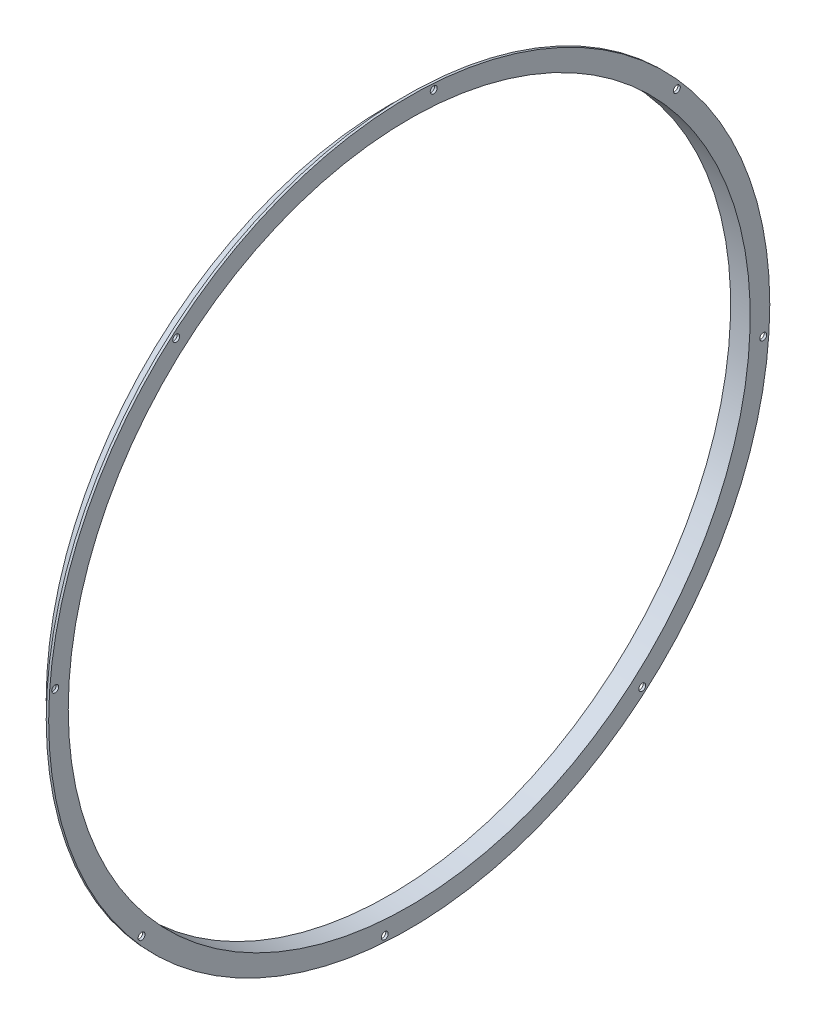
ISO-10303-21;
HEADER;
FILE_DESCRIPTION(('STEP AP214'),'2;1');
FILE_NAME('part.step','',(''),(''),'','','');
FILE_SCHEMA(('AUTOMOTIVE_DESIGN { 1 0 10303 214 1 1 1 1 }'));
ENDSEC;
DATA;
#1=APPLICATION_CONTEXT('core data for automotive mechanical design processes');
#2=APPLICATION_PROTOCOL_DEFINITION('international standard','automotive_design',2000,#1);
#3=PRODUCT_CONTEXT('',#1,'mechanical');
#4=PRODUCT('Part','Part','',(#3));
#5=PRODUCT_RELATED_PRODUCT_CATEGORY('part','',(#4));
#6=PRODUCT_DEFINITION_FORMATION('','',#4);
#7=PRODUCT_DEFINITION_CONTEXT('part definition',#1,'design');
#8=PRODUCT_DEFINITION('design','',#6,#7);
#9=PRODUCT_DEFINITION_SHAPE('','',#8);
#10=(LENGTH_UNIT() NAMED_UNIT(*) SI_UNIT(.MILLI.,.METRE.));
#11=(NAMED_UNIT(*) PLANE_ANGLE_UNIT() SI_UNIT($,.RADIAN.));
#12=(NAMED_UNIT(*) SI_UNIT($,.STERADIAN.) SOLID_ANGLE_UNIT());
#13=UNCERTAINTY_MEASURE_WITH_UNIT(LENGTH_MEASURE(1.E-05),#10,'distance_accuracy_value','');
#14=(GEOMETRIC_REPRESENTATION_CONTEXT(3) GLOBAL_UNCERTAINTY_ASSIGNED_CONTEXT((#13)) GLOBAL_UNIT_ASSIGNED_CONTEXT((#10,
#11,#12)) REPRESENTATION_CONTEXT('',''));
#15=CARTESIAN_POINT('',(0.,0.,0.));
#16=DIRECTION('',(0.,0.,1.));
#17=DIRECTION('',(1.,0.,0.));
#18=AXIS2_PLACEMENT_3D('',#15,#16,#17);
#19=CARTESIAN_POINT('',(-76.2,1336.675,0.));
#20=DIRECTION('',(1.,0.,0.));
#21=DIRECTION('',(0.,0.,-1.));
#22=AXIS2_PLACEMENT_3D('',#19,#20,#21);
#23=PLANE('',#22);
#24=CARTESIAN_POINT('',(-76.2,0.,0.));
#25=DIRECTION('',(-1.,0.,0.));
#26=DIRECTION('',(0.,0.,1.));
#27=AXIS2_PLACEMENT_3D('',#24,#25,#26);
#28=CIRCLE('',#27,1327.15);
#29=CARTESIAN_POINT('',(-76.2,0.,1327.15));
#30=VERTEX_POINT('',#29);
#31=EDGE_CURVE('E9',#30,#30,#28,.T.);
#32=ORIENTED_EDGE('',*,*,#31,.F.);
#33=EDGE_LOOP('',(#32));
#34=FACE_BOUND('',#33,.T.);
#35=CARTESIAN_POINT('',(-76.2,0.,0.));
#36=DIRECTION('',(-1.,0.,0.));
#37=DIRECTION('',(0.,0.,1.));
#38=AXIS2_PLACEMENT_3D('',#35,#36,#37);
#39=CIRCLE('',#38,1336.675);
#40=CARTESIAN_POINT('',(-76.2,0.,1336.675));
#41=VERTEX_POINT('',#40);
#42=EDGE_CURVE('E33',#41,#41,#39,.T.);
#43=ORIENTED_EDGE('',*,*,#42,.T.);
#44=EDGE_LOOP('',(#43));
#45=FACE_BOUND('',#44,.T.);
#46=ADVANCED_FACE('F14',(#34,#45),#23,.F.);
#47=CARTESIAN_POINT('',(-301.625,0.,0.));
#48=DIRECTION('',(-1.,0.,0.));
#49=DIRECTION('',(0.,0.,1.));
#50=AXIS2_PLACEMENT_3D('',#47,#48,#49);
#51=CYLINDRICAL_SURFACE('',#50,1327.15);
#52=CARTESIAN_POINT('',(0.,0.,0.));
#53=DIRECTION('',(-1.,0.,0.));
#54=DIRECTION('',(0.,0.,1.));
#55=AXIS2_PLACEMENT_3D('',#52,#53,#54);
#56=CIRCLE('',#55,1327.15);
#57=CARTESIAN_POINT('',(0.,0.,1327.15));
#58=VERTEX_POINT('',#57);
#59=EDGE_CURVE('E21',#58,#58,#56,.T.);
#60=ORIENTED_EDGE('',*,*,#59,.F.);
#61=EDGE_LOOP('',(#60));
#62=FACE_BOUND('',#61,.T.);
#63=ORIENTED_EDGE('',*,*,#31,.T.);
#64=EDGE_LOOP('',(#63));
#65=FACE_BOUND('',#64,.T.);
#66=ADVANCED_FACE('F94',(#62,#65),#51,.F.);
#67=CARTESIAN_POINT('',(0.,1327.15,0.));
#68=DIRECTION('',(-1.,0.,0.));
#69=DIRECTION('',(0.,0.,1.));
#70=AXIS2_PLACEMENT_3D('',#67,#68,#69);
#71=PLANE('',#70);
#72=CARTESIAN_POINT('',(1.91344239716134E-13,1041.62952588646,906.925684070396));
#73=DIRECTION('',(1.,0.,0.));
#74=DIRECTION('',(0.,0.707106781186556,0.707106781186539));
#75=AXIS2_PLACEMENT_3D('',#72,#73,#74);
#76=CIRCLE('',#75,13.49375);
#77=CARTESIAN_POINT('',(1.93096988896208E-13,1051.17104801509,916.467206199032));
#78=VERTEX_POINT('',#77);
#79=EDGE_CURVE('E66',#78,#78,#76,.T.);
#80=ORIENTED_EDGE('',*,*,#79,.F.);
#81=EDGE_LOOP('',(#80));
#82=FACE_BOUND('',#81,.T.);
#83=CARTESIAN_POINT('',(0.,95.2500000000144,1377.83660247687));
#84=DIRECTION('',(1.,0.,0.));
#85=DIRECTION('',(0.,0.,1.));
#86=AXIS2_PLACEMENT_3D('',#83,#84,#85);
#87=CIRCLE('',#86,13.49375);
#88=CARTESIAN_POINT('',(0.,95.2500000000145,1391.33035247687));
#89=VERTEX_POINT('',#88);
#90=EDGE_CURVE('E56',#89,#89,#87,.T.);
#91=ORIENTED_EDGE('',*,*,#90,.F.);
#92=EDGE_LOOP('',(#91));
#93=FACE_BOUND('',#92,.T.);
#94=CARTESIAN_POINT('',(-1.66599545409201E-13,-906.925684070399,1041.62952588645));
#95=DIRECTION('',(1.,0.,0.));
#96=DIRECTION('',(0.,-0.707106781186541,0.707106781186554));
#97=AXIS2_PLACEMENT_3D('',#94,#95,#96);
#98=CIRCLE('',#97,13.49375);
#99=CARTESIAN_POINT('',(-1.68352294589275E-13,-916.467206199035,1051.17104801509));
#100=VERTEX_POINT('',#99);
#101=EDGE_CURVE('E53',#100,#100,#98,.T.);
#102=ORIENTED_EDGE('',*,*,#101,.F.);
#103=EDGE_LOOP('',(#102));
#104=FACE_BOUND('',#103,.T.);
#105=CARTESIAN_POINT('',(-2.53104477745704E-13,-1377.83660247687,95.2500000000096));
#106=DIRECTION('',(1.,0.,0.));
#107=DIRECTION('',(0.,-1.,0.));
#108=AXIS2_PLACEMENT_3D('',#105,#106,#107);
#109=CIRCLE('',#108,13.49375);
#110=CARTESIAN_POINT('',(-2.55583239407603E-13,-1391.33035247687,95.2500000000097));
#111=VERTEX_POINT('',#110);
#112=EDGE_CURVE('E50',#111,#111,#109,.T.);
#113=ORIENTED_EDGE('',*,*,#112,.F.);
#114=EDGE_LOOP('',(#113));
#115=FACE_BOUND('',#114,.T.);
#116=CARTESIAN_POINT('',(-1.91344239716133E-13,-1041.62952588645,-906.925684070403));
#117=DIRECTION('',(1.,0.,0.));
#118=DIRECTION('',(0.,-0.707106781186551,-0.707106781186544));
#119=AXIS2_PLACEMENT_3D('',#116,#117,#118);
#120=CIRCLE('',#119,13.49375);
#121=CARTESIAN_POINT('',(-1.93096988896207E-13,-1051.17104801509,-916.467206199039));
#122=VERTEX_POINT('',#121);
#123=EDGE_CURVE('E46',#122,#122,#120,.T.);
#124=ORIENTED_EDGE('',*,*,#123,.F.);
#125=EDGE_LOOP('',(#124));
#126=FACE_BOUND('',#125,.T.);
#127=CARTESIAN_POINT('',(0.,-95.2500000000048,-1377.83660247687));
#128=DIRECTION('',(1.,0.,0.));
#129=DIRECTION('',(0.,0.,-1.));
#130=AXIS2_PLACEMENT_3D('',#127,#128,#129);
#131=CIRCLE('',#130,13.49375);
#132=CARTESIAN_POINT('',(0.,-95.2500000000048,-1391.33035247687));
#133=VERTEX_POINT('',#132);
#134=EDGE_CURVE('E42',#133,#133,#131,.T.);
#135=ORIENTED_EDGE('',*,*,#134,.F.);
#136=EDGE_LOOP('',(#135));
#137=FACE_BOUND('',#136,.T.);
#138=CARTESIAN_POINT('',(1.66599545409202E-13,906.925684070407,-1041.62952588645));
#139=DIRECTION('',(1.,0.,0.));
#140=DIRECTION('',(0.,0.707106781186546,-0.707106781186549));
#141=AXIS2_PLACEMENT_3D('',#138,#139,#140);
#142=CIRCLE('',#141,13.49375);
#143=CARTESIAN_POINT('',(1.68352294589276E-13,916.467206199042,-1051.17104801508));
#144=VERTEX_POINT('',#143);
#145=EDGE_CURVE('E38',#144,#144,#142,.T.);
#146=ORIENTED_EDGE('',*,*,#145,.F.);
#147=EDGE_LOOP('',(#146));
#148=FACE_BOUND('',#147,.T.);
#149=CARTESIAN_POINT('',(2.53104477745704E-13,1377.83660247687,-95.2499999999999));
#150=DIRECTION('',(1.,0.,0.));
#151=DIRECTION('',(0.,1.,0.));
#152=AXIS2_PLACEMENT_3D('',#149,#150,#151);
#153=CIRCLE('',#152,13.49375);
#154=CARTESIAN_POINT('',(2.55583239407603E-13,1391.33035247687,-95.2499999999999));
#155=VERTEX_POINT('',#154);
#156=EDGE_CURVE('E34',#155,#155,#153,.T.);
#157=ORIENTED_EDGE('',*,*,#156,.F.);
#158=EDGE_LOOP('',(#157));
#159=FACE_BOUND('',#158,.T.);
#160=CARTESIAN_POINT('',(0.,0.,0.));
#161=DIRECTION('',(-1.,0.,0.));
#162=DIRECTION('',(0.,0.,1.));
#163=AXIS2_PLACEMENT_3D('',#160,#161,#162);
#164=CIRCLE('',#163,1403.35);
#165=CARTESIAN_POINT('',(0.,0.,1403.35));
#166=VERTEX_POINT('',#165);
#167=EDGE_CURVE('E26',#166,#166,#164,.T.);
#168=ORIENTED_EDGE('',*,*,#167,.F.);
#169=EDGE_LOOP('',(#168));
#170=FACE_BOUND('',#169,.T.);
#171=ORIENTED_EDGE('',*,*,#59,.T.);
#172=EDGE_LOOP('',(#171));
#173=FACE_BOUND('',#172,.T.);
#174=ADVANCED_FACE('F91',(#82,#93,#104,#115,#126,#137,#148,#159,#170,#173),#71,.F.);
#175=CARTESIAN_POINT('',(-301.625,0.,0.));
#176=DIRECTION('',(-1.,0.,0.));
#177=DIRECTION('',(0.,0.,1.));
#178=AXIS2_PLACEMENT_3D('',#175,#176,#177);
#179=CYLINDRICAL_SURFACE('',#178,1403.35);
#180=CARTESIAN_POINT('',(-9.52500000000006,0.,0.));
#181=DIRECTION('',(-1.,0.,0.));
#182=DIRECTION('',(0.,0.,1.));
#183=AXIS2_PLACEMENT_3D('',#180,#181,#182);
#184=CIRCLE('',#183,1403.35);
#185=CARTESIAN_POINT('',(-9.52500000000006,0.,1403.35));
#186=VERTEX_POINT('',#185);
#187=EDGE_CURVE('E84',#186,#186,#184,.T.);
#188=ORIENTED_EDGE('',*,*,#187,.F.);
#189=EDGE_LOOP('',(#188));
#190=FACE_BOUND('',#189,.T.);
#191=ORIENTED_EDGE('',*,*,#167,.T.);
#192=EDGE_LOOP('',(#191));
#193=FACE_BOUND('',#192,.T.);
#194=ADVANCED_FACE('F89',(#190,#193),#179,.T.);
#195=CARTESIAN_POINT('',(-9.52500000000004,1403.35,0.));
#196=DIRECTION('',(1.,0.,0.));
#197=DIRECTION('',(0.,0.,-1.));
#198=AXIS2_PLACEMENT_3D('',#195,#196,#197);
#199=PLANE('',#198);
#200=CARTESIAN_POINT('',(-9.52500000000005,1041.62952588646,906.925684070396));
#201=DIRECTION('',(1.,0.,0.));
#202=DIRECTION('',(0.,0.,-1.));
#203=AXIS2_PLACEMENT_3D('',#200,#201,#202);
#204=CIRCLE('',#203,13.49375);
#205=CARTESIAN_POINT('',(-9.52500000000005,1041.62952588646,893.431934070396));
#206=VERTEX_POINT('',#205);
#207=EDGE_CURVE('E17',#206,#206,#204,.T.);
#208=ORIENTED_EDGE('',*,*,#207,.T.);
#209=EDGE_LOOP('',(#208));
#210=FACE_BOUND('',#209,.T.);
#211=CARTESIAN_POINT('',(-9.52500000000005,95.2500000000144,1377.83660247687));
#212=DIRECTION('',(1.,0.,0.));
#213=DIRECTION('',(0.,0.,-1.));
#214=AXIS2_PLACEMENT_3D('',#211,#212,#213);
#215=CIRCLE('',#214,13.49375);
#216=CARTESIAN_POINT('',(-9.52500000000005,95.2500000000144,1364.34285247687));
#217=VERTEX_POINT('',#216);
#218=EDGE_CURVE('E54',#217,#217,#215,.T.);
#219=ORIENTED_EDGE('',*,*,#218,.T.);
#220=EDGE_LOOP('',(#219));
#221=FACE_BOUND('',#220,.T.);
#222=CARTESIAN_POINT('',(-9.52500000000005,-906.925684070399,1041.62952588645));
#223=DIRECTION('',(1.,0.,0.));
#224=DIRECTION('',(0.,0.,-1.));
#225=AXIS2_PLACEMENT_3D('',#222,#223,#224);
#226=CIRCLE('',#225,13.49375);
#227=CARTESIAN_POINT('',(-9.52500000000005,-906.925684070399,1028.13577588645));
#228=VERTEX_POINT('',#227);
#229=EDGE_CURVE('E51',#228,#228,#226,.T.);
#230=ORIENTED_EDGE('',*,*,#229,.T.);
#231=EDGE_LOOP('',(#230));
#232=FACE_BOUND('',#231,.T.);
#233=CARTESIAN_POINT('',(-9.52500000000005,-1377.83660247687,95.2500000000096));
#234=DIRECTION('',(1.,0.,0.));
#235=DIRECTION('',(0.,0.,-1.));
#236=AXIS2_PLACEMENT_3D('',#233,#234,#235);
#237=CIRCLE('',#236,13.49375);
#238=CARTESIAN_POINT('',(-9.52500000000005,-1377.83660247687,81.7562500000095));
#239=VERTEX_POINT('',#238);
#240=EDGE_CURVE('E47',#239,#239,#237,.T.);
#241=ORIENTED_EDGE('',*,*,#240,.T.);
#242=EDGE_LOOP('',(#241));
#243=FACE_BOUND('',#242,.T.);
#244=CARTESIAN_POINT('',(-9.52500000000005,-1041.62952588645,-906.925684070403));
#245=DIRECTION('',(1.,0.,0.));
#246=DIRECTION('',(0.,0.,-1.));
#247=AXIS2_PLACEMENT_3D('',#244,#245,#246);
#248=CIRCLE('',#247,13.49375);
#249=CARTESIAN_POINT('',(-9.52500000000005,-1041.62952588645,-920.419434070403));
#250=VERTEX_POINT('',#249);
#251=EDGE_CURVE('E43',#250,#250,#248,.T.);
#252=ORIENTED_EDGE('',*,*,#251,.T.);
#253=EDGE_LOOP('',(#252));
#254=FACE_BOUND('',#253,.T.);
#255=CARTESIAN_POINT('',(-9.52500000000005,-95.2500000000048,-1377.83660247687));
#256=DIRECTION('',(1.,0.,0.));
#257=DIRECTION('',(0.,0.,-1.));
#258=AXIS2_PLACEMENT_3D('',#255,#256,#257);
#259=CIRCLE('',#258,13.49375);
#260=CARTESIAN_POINT('',(-9.52500000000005,-95.2500000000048,-1391.33035247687));
#261=VERTEX_POINT('',#260);
#262=EDGE_CURVE('E39',#261,#261,#259,.T.);
#263=ORIENTED_EDGE('',*,*,#262,.T.);
#264=EDGE_LOOP('',(#263));
#265=FACE_BOUND('',#264,.T.);
#266=CARTESIAN_POINT('',(-9.52500000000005,906.925684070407,-1041.62952588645));
#267=DIRECTION('',(1.,0.,0.));
#268=DIRECTION('',(0.,0.,-1.));
#269=AXIS2_PLACEMENT_3D('',#266,#267,#268);
#270=CIRCLE('',#269,13.49375);
#271=CARTESIAN_POINT('',(-9.52500000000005,906.925684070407,-1055.12327588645));
#272=VERTEX_POINT('',#271);
#273=EDGE_CURVE('E35',#272,#272,#270,.T.);
#274=ORIENTED_EDGE('',*,*,#273,.T.);
#275=EDGE_LOOP('',(#274));
#276=FACE_BOUND('',#275,.T.);
#277=CARTESIAN_POINT('',(-9.52500000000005,1377.83660247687,-95.2499999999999));
#278=DIRECTION('',(1.,0.,0.));
#279=DIRECTION('',(0.,0.,-1.));
#280=AXIS2_PLACEMENT_3D('',#277,#278,#279);
#281=CIRCLE('',#280,13.49375);
#282=CARTESIAN_POINT('',(-9.52500000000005,1377.83660247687,-108.74375));
#283=VERTEX_POINT('',#282);
#284=EDGE_CURVE('E30',#283,#283,#281,.T.);
#285=ORIENTED_EDGE('',*,*,#284,.T.);
#286=EDGE_LOOP('',(#285));
#287=FACE_BOUND('',#286,.T.);
#288=CARTESIAN_POINT('',(-9.52500000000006,0.,0.));
#289=DIRECTION('',(-1.,0.,0.));
#290=DIRECTION('',(0.,0.,1.));
#291=AXIS2_PLACEMENT_3D('',#288,#289,#290);
#292=CIRCLE('',#291,1336.675);
#293=CARTESIAN_POINT('',(-9.52500000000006,0.,1336.675));
#294=VERTEX_POINT('',#293);
#295=EDGE_CURVE('E81',#294,#294,#292,.T.);
#296=ORIENTED_EDGE('',*,*,#295,.F.);
#297=EDGE_LOOP('',(#296));
#298=FACE_BOUND('',#297,.T.);
#299=ORIENTED_EDGE('',*,*,#187,.T.);
#300=EDGE_LOOP('',(#299));
#301=FACE_BOUND('',#300,.T.);
#302=ADVANCED_FACE('F109',(#210,#221,#232,#243,#254,#265,#276,#287,#298,#301),#199,.F.);
#303=CARTESIAN_POINT('',(-301.625,0.,0.));
#304=DIRECTION('',(-1.,0.,0.));
#305=DIRECTION('',(0.,0.,1.));
#306=AXIS2_PLACEMENT_3D('',#303,#304,#305);
#307=CYLINDRICAL_SURFACE('',#306,1336.675);
#308=ORIENTED_EDGE('',*,*,#42,.F.);
#309=EDGE_LOOP('',(#308));
#310=FACE_BOUND('',#309,.T.);
#311=ORIENTED_EDGE('',*,*,#295,.T.);
#312=EDGE_LOOP('',(#311));
#313=FACE_BOUND('',#312,.T.);
#314=ADVANCED_FACE('F113',(#310,#313),#307,.T.);
#315=CARTESIAN_POINT('',(-76.2,1377.83660247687,-95.2499999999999));
#316=DIRECTION('',(1.,0.,0.));
#317=DIRECTION('',(0.,1.,0.));
#318=AXIS2_PLACEMENT_3D('',#315,#316,#317);
#319=CYLINDRICAL_SURFACE('',#318,13.49375);
#320=ORIENTED_EDGE('',*,*,#156,.T.);
#321=EDGE_LOOP('',(#320));
#322=FACE_BOUND('',#321,.T.);
#323=ORIENTED_EDGE('',*,*,#284,.F.);
#324=EDGE_LOOP('',(#323));
#325=FACE_BOUND('',#324,.T.);
#326=ADVANCED_FACE('F117',(#322,#325),#319,.F.);
#327=CARTESIAN_POINT('',(-76.2000000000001,906.925684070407,-1041.62952588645));
#328=DIRECTION('',(1.,0.,0.));
#329=DIRECTION('',(0.,1.,0.));
#330=AXIS2_PLACEMENT_3D('',#327,#328,#329);
#331=CYLINDRICAL_SURFACE('',#330,13.49375);
#332=ORIENTED_EDGE('',*,*,#145,.T.);
#333=EDGE_LOOP('',(#332));
#334=FACE_BOUND('',#333,.T.);
#335=ORIENTED_EDGE('',*,*,#273,.F.);
#336=EDGE_LOOP('',(#335));
#337=FACE_BOUND('',#336,.T.);
#338=ADVANCED_FACE('F121',(#334,#337),#331,.F.);
#339=CARTESIAN_POINT('',(-76.2000000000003,-95.2500000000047,-1377.83660247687));
#340=DIRECTION('',(1.,0.,0.));
#341=DIRECTION('',(0.,1.,0.));
#342=AXIS2_PLACEMENT_3D('',#339,#340,#341);
#343=CYLINDRICAL_SURFACE('',#342,13.49375);
#344=ORIENTED_EDGE('',*,*,#134,.T.);
#345=EDGE_LOOP('',(#344));
#346=FACE_BOUND('',#345,.T.);
#347=ORIENTED_EDGE('',*,*,#262,.F.);
#348=EDGE_LOOP('',(#347));
#349=FACE_BOUND('',#348,.T.);
#350=ADVANCED_FACE('F125',(#346,#349),#343,.F.);
#351=CARTESIAN_POINT('',(-76.2000000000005,-1041.62952588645,-906.925684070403));
#352=DIRECTION('',(1.,0.,0.));
#353=DIRECTION('',(0.,1.,0.));
#354=AXIS2_PLACEMENT_3D('',#351,#352,#353);
#355=CYLINDRICAL_SURFACE('',#354,13.49375);
#356=ORIENTED_EDGE('',*,*,#123,.T.);
#357=EDGE_LOOP('',(#356));
#358=FACE_BOUND('',#357,.T.);
#359=ORIENTED_EDGE('',*,*,#251,.F.);
#360=EDGE_LOOP('',(#359));
#361=FACE_BOUND('',#360,.T.);
#362=ADVANCED_FACE('F129',(#358,#361),#355,.F.);
#363=CARTESIAN_POINT('',(-76.2000000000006,-1377.83660247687,95.2500000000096));
#364=DIRECTION('',(1.,0.,0.));
#365=DIRECTION('',(0.,1.,0.));
#366=AXIS2_PLACEMENT_3D('',#363,#364,#365);
#367=CYLINDRICAL_SURFACE('',#366,13.49375);
#368=ORIENTED_EDGE('',*,*,#112,.T.);
#369=EDGE_LOOP('',(#368));
#370=FACE_BOUND('',#369,.T.);
#371=ORIENTED_EDGE('',*,*,#240,.F.);
#372=EDGE_LOOP('',(#371));
#373=FACE_BOUND('',#372,.T.);
#374=ADVANCED_FACE('F133',(#370,#373),#367,.F.);
#375=CARTESIAN_POINT('',(-76.2000000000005,-906.925684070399,1041.62952588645));
#376=DIRECTION('',(1.,0.,0.));
#377=DIRECTION('',(0.,1.,0.));
#378=AXIS2_PLACEMENT_3D('',#375,#376,#377);
#379=CYLINDRICAL_SURFACE('',#378,13.49375);
#380=ORIENTED_EDGE('',*,*,#101,.T.);
#381=EDGE_LOOP('',(#380));
#382=FACE_BOUND('',#381,.T.);
#383=ORIENTED_EDGE('',*,*,#229,.F.);
#384=EDGE_LOOP('',(#383));
#385=FACE_BOUND('',#384,.T.);
#386=ADVANCED_FACE('F137',(#382,#385),#379,.F.);
#387=CARTESIAN_POINT('',(-76.2000000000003,95.2500000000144,1377.83660247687));
#388=DIRECTION('',(1.,0.,0.));
#389=DIRECTION('',(0.,1.,0.));
#390=AXIS2_PLACEMENT_3D('',#387,#388,#389);
#391=CYLINDRICAL_SURFACE('',#390,13.49375);
#392=ORIENTED_EDGE('',*,*,#90,.T.);
#393=EDGE_LOOP('',(#392));
#394=FACE_BOUND('',#393,.T.);
#395=ORIENTED_EDGE('',*,*,#218,.F.);
#396=EDGE_LOOP('',(#395));
#397=FACE_BOUND('',#396,.T.);
#398=ADVANCED_FACE('F141',(#394,#397),#391,.F.);
#399=CARTESIAN_POINT('',(-76.2000000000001,1041.62952588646,906.925684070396));
#400=DIRECTION('',(1.,0.,0.));
#401=DIRECTION('',(0.,1.,0.));
#402=AXIS2_PLACEMENT_3D('',#399,#400,#401);
#403=CYLINDRICAL_SURFACE('',#402,13.49375);
#404=ORIENTED_EDGE('',*,*,#79,.T.);
#405=EDGE_LOOP('',(#404));
#406=FACE_BOUND('',#405,.T.);
#407=ORIENTED_EDGE('',*,*,#207,.F.);
#408=EDGE_LOOP('',(#407));
#409=FACE_BOUND('',#408,.T.);
#410=ADVANCED_FACE('F145',(#406,#409),#403,.F.);
#411=CLOSED_SHELL('',(#46,#66,#174,#194,#302,#314,#326,#338,#350,#362,#374,#386,#398,#410));
#412=MANIFOLD_SOLID_BREP('B1',#411);
#413=ADVANCED_BREP_SHAPE_REPRESENTATION('',(#18,#412),#14);
#414=SHAPE_DEFINITION_REPRESENTATION(#9,#413);
ENDSEC;
END-ISO-10303-21;
